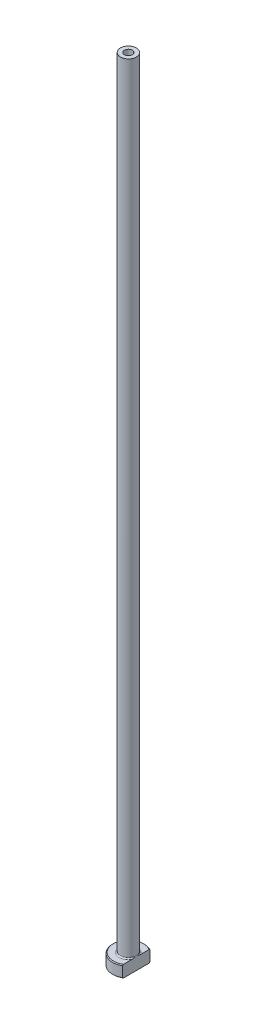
from build123d import *

# Parameters (mm, degrees)
FILLET1_R          = 0.3
CHAMFER1_SIZE      = 0.2
CUT_EXTRUDE1_DEPTH = 201.079984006
CHAMFER2_SIZE      = 0.5


with BuildPart() as part:
    # Sketch1 → Revolve1 (revolve)
    with BuildSketch(Plane.XY, mode=Mode.PRIVATE) as revolve1_sk:
        Polygon((-1, 200), (-2, 200), (-2, 3), (-4, 3), (-4, 0), (-1.25, 0), (-1.25, 153), (-1, 165), align=None)
    revolve(revolve1_sk.sketch.rotate(Axis((0, 92.187680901, 0), (0, -1, 0)), 270), axis=Axis((0, 92.187680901, 0), (0, -1, 0)))

    # Fillet1
    fillet1_edges = [part.edges().sort_by_distance(p)[0] for p in [
        (0, 3, -2),
    ]]
    fillet(fillet1_edges, radius=FILLET1_R)

    # Chamfer1
    chamfer1_edges = [part.edges().sort_by_distance(p)[0] for p in [
        (0, 0, -4),
        (0, 3, -4),
    ]]
    chamfer(chamfer1_edges, length=CHAMFER1_SIZE)

    # Sketch2 → Cut-Extrude1 (cut, through all)
    with BuildSketch(Plane.XZ):
        with BuildLine():
            Line((2, 3.464101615), (2, -3.464101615))
            ThreePointArc((2, -3.464101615), (4, 0), (2, 3.464101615))
        make_face()
    extrude(amount=-CUT_EXTRUDE1_DEPTH, mode=Mode.SUBTRACT)

    # Chamfer2
    chamfer2_edges = [part.edges().sort_by_distance(p)[0] for p in [
        (0, 0, -1.25),
    ]]
    chamfer(chamfer2_edges, length=CHAMFER2_SIZE)


solid = part.part
